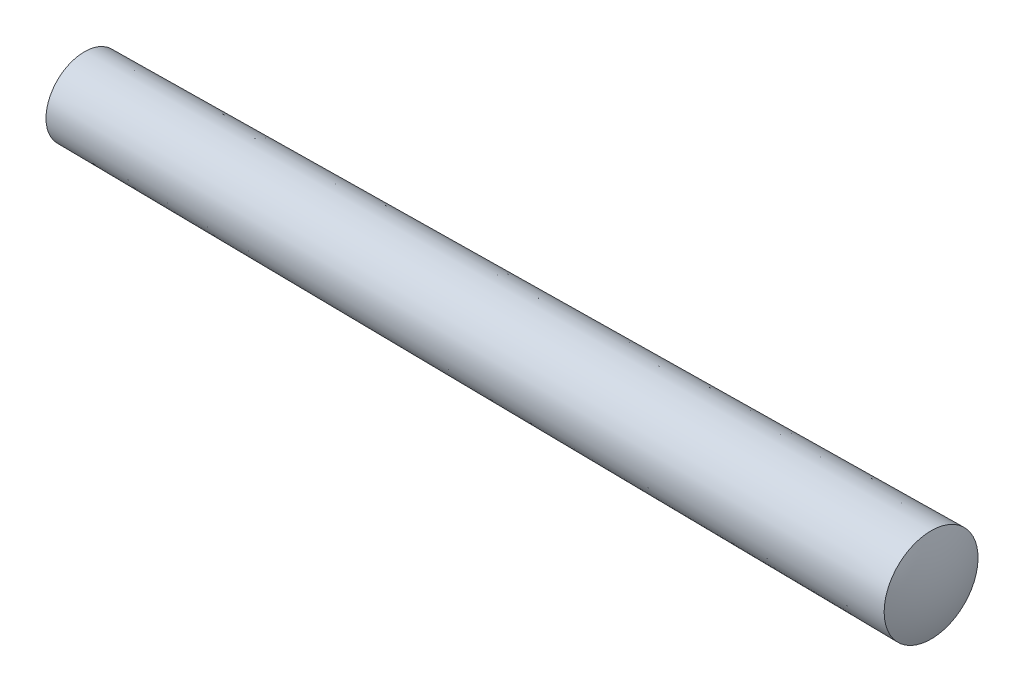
from build123d import *


with BuildPart() as part:
    # Sketch1 → Base-Revolve (revolve)
    with BuildSketch(Plane.XY):
        with BuildLine():
            Line((0.5, 2), (44.5, 2.439999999))
            ThreePointArc((44.5, 2.439999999), (44.873714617, 1.245351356), (45, 0))
            Line((45, 0), (0, 0))
            ThreePointArc((0, 0), (0.126894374, 1.030776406), (0.5, 2))
        make_face()
    revolve(axis=Axis((0, 0, 0), (1, 0, 0)))


solid = part.part
